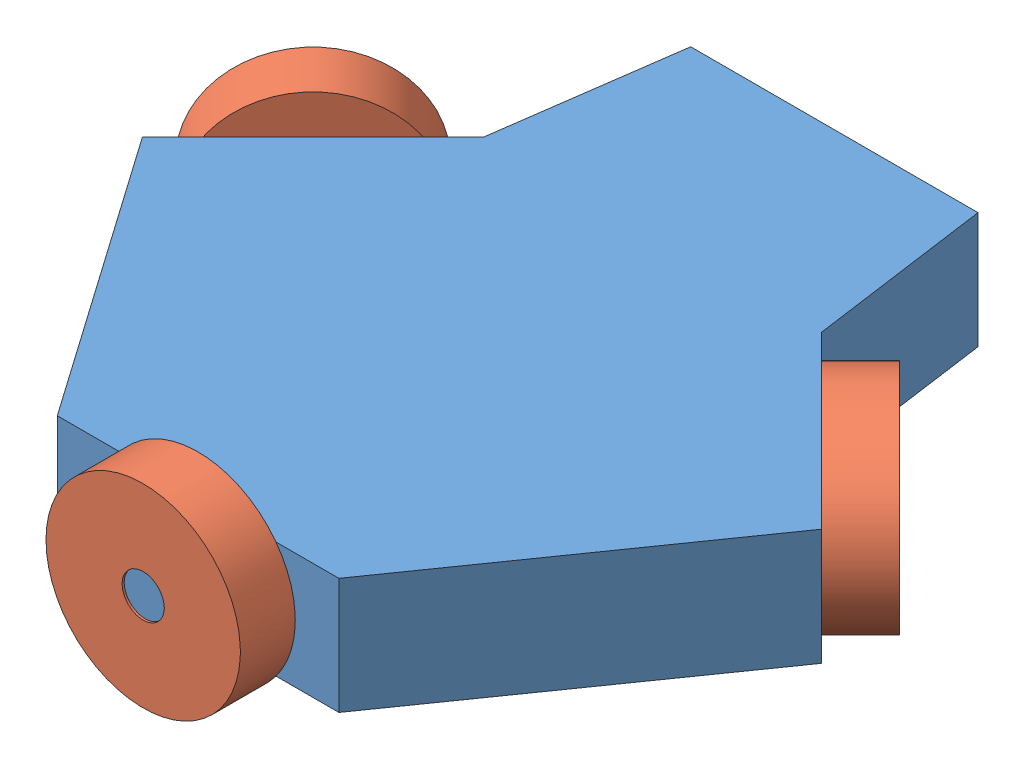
SolidWorks assembly simpleModel.SLDASM, configuration Default (file format 10000). Lengths in mm.
Overall size (415.7 203.08 431.32).
4 component instances, 2 part files, 6 mates.
Components (placement in the parent):
- simPart1-1: simPart1.SLDPRT [Default] at (125.7678 129.5793 94.1115) size (321.56 55 326.21)
- simPart2-1: simPart2.SLDPRT [Default] at (5.3779 157.0793 220.5014) x (0.707107 0 -0.707107) z (0 1 0) size (92 26 92)
- simPart2-2: simPart2.SLDPRT [Default] at (125.7678 157.0793 395.318) x (0 1 0) z (1 0 0) size (92 26 92)
- simPart2-3: simPart2.SLDPRT [Default] at (264.5426 157.0793 202.1167) x (0 1 0) z (0.707107 0 0.707107) size (92 26 92)
Mates (geometry in assembly coordinates):
- Concentric1: concentric aligned: cylinder of simPart1-1 through (-12.2998 157.0793 202.8238) axis (0.707107 0 0.707107) radius 10; cylinder of simPart2-1 through (-13.0069 157.0793 202.1167) axis (0.707107 0 0.707107) radius 10
- Coincident1: coincident anti-aligned: plane of simPart1-1 through (128.7678 184.5793 97.1115) normal (-0.707107 0 -0.707107); plane of simPart2-1 through (5.3779 157.0793 220.5014) normal (0.707107 0 0.707107)
- Concentric2: concentric anti-aligned: cylinder of simPart1-1 through (263.8354 157.0793 202.8238) axis (-0.707107 0 0.707107) radius 10; cylinder of simPart2-3 through (246.1578 157.0793 220.5014) axis (0.707107 0 -0.707107) radius 10
- Coincident2: coincident anti-aligned: plane of simPart1-1 through (122.7678 184.5793 97.1115) normal (0.707107 0 -0.707107); plane of simPart2-3 through (246.1578 157.0793 220.5014) normal (-0.707107 0 0.707107)
- Coincident3: coincident anti-aligned: plane of simPart1-1 through (125.7678 184.5793 395.318) normal (0 0 1); plane of simPart2-2 through (125.7678 157.0793 395.318) normal (0 0 -1)
- Concentric3: concentric aligned: cylinder of simPart1-1 through (125.7678 157.0793 420.318) axis (0 0 -1) radius 10; cylinder of simPart2-2 through (125.7678 157.0793 421.318) axis (0 0 -1) radius 10
